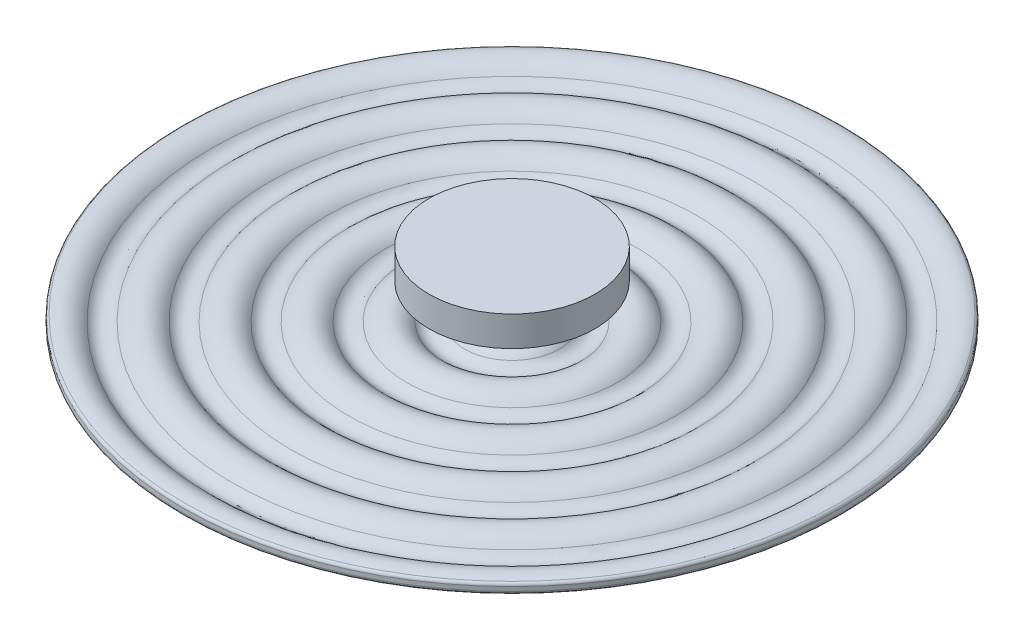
ISO-10303-21;
HEADER;
FILE_DESCRIPTION(('STEP AP214'),'2;1');
FILE_NAME('part.step','',(''),(''),'','','');
FILE_SCHEMA(('AUTOMOTIVE_DESIGN { 1 0 10303 214 1 1 1 1 }'));
ENDSEC;
DATA;
#1=APPLICATION_CONTEXT('core data for automotive mechanical design processes');
#2=APPLICATION_PROTOCOL_DEFINITION('international standard','automotive_design',2000,#1);
#3=PRODUCT_CONTEXT('',#1,'mechanical');
#4=PRODUCT('Part','Part','',(#3));
#5=PRODUCT_RELATED_PRODUCT_CATEGORY('part','',(#4));
#6=PRODUCT_DEFINITION_FORMATION('','',#4);
#7=PRODUCT_DEFINITION_CONTEXT('part definition',#1,'design');
#8=PRODUCT_DEFINITION('design','',#6,#7);
#9=PRODUCT_DEFINITION_SHAPE('','',#8);
#10=(LENGTH_UNIT() NAMED_UNIT(*) SI_UNIT(.MILLI.,.METRE.));
#11=(NAMED_UNIT(*) PLANE_ANGLE_UNIT() SI_UNIT($,.RADIAN.));
#12=(NAMED_UNIT(*) SI_UNIT($,.STERADIAN.) SOLID_ANGLE_UNIT());
#13=UNCERTAINTY_MEASURE_WITH_UNIT(LENGTH_MEASURE(1.E-05),#10,'distance_accuracy_value','');
#14=(GEOMETRIC_REPRESENTATION_CONTEXT(3) GLOBAL_UNCERTAINTY_ASSIGNED_CONTEXT((#13)) GLOBAL_UNIT_ASSIGNED_CONTEXT((#10,
#11,#12)) REPRESENTATION_CONTEXT('',''));
#15=CARTESIAN_POINT('',(0.,0.,0.));
#16=DIRECTION('',(0.,0.,1.));
#17=DIRECTION('',(1.,0.,0.));
#18=AXIS2_PLACEMENT_3D('',#15,#16,#17);
#19=CARTESIAN_POINT('',(0.,10.,0.));
#20=DIRECTION('',(0.,1.,0.));
#21=DIRECTION('',(1.,0.,0.));
#22=AXIS2_PLACEMENT_3D('',#19,#20,#21);
#23=SPHERICAL_SURFACE('',#22,11.);
#24=CARTESIAN_POINT('',(0.,2.66666666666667,0.));
#25=DIRECTION('',(0.,1.,0.));
#26=DIRECTION('',(-1.,0.,0.));
#27=AXIS2_PLACEMENT_3D('',#24,#25,#26);
#28=CIRCLE('',#27,8.19891591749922);
#29=CARTESIAN_POINT('',(8.19891591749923,2.66666666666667,0.));
#30=VERTEX_POINT('',#29);
#31=EDGE_CURVE('E155',#30,#30,#28,.T.);
#32=CARTESIAN_POINT('',(0.,0.202041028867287,0.));
#33=DIRECTION('',(0.,1.,0.));
#34=DIRECTION('',(0.,0.,1.));
#35=AXIS2_PLACEMENT_3D('',#32,#33,#34);
#36=CIRCLE('',#35,5.);
#37=CARTESIAN_POINT('',(4.99999999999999,0.202041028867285,0.));
#38=VERTEX_POINT('',#37);
#39=EDGE_CURVE('E70',#38,#38,#36,.T.);
#40=CARTESIAN_POINT('',(8.19891591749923,2.66666666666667,0.));
#41=CARTESIAN_POINT('',(8.17071262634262,2.63513441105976,0.));
#42=CARTESIAN_POINT('',(8.14232741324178,2.6037648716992,0.));
#43=CARTESIAN_POINT('',(8.08519695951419,2.54135536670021,0.));
#44=CARTESIAN_POINT('',(8.05645171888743,2.51031540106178,0.));
#45=CARTESIAN_POINT('',(7.9986050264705,2.44856918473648,0.));
#46=CARTESIAN_POINT('',(7.96950357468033,2.41786293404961,0.));
#47=CARTESIAN_POINT('',(7.91094833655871,2.35678823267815,0.));
#48=CARTESIAN_POINT('',(7.88149455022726,2.32641978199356,0.));
#49=CARTESIAN_POINT('',(7.82223856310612,2.26602472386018,0.));
#50=CARTESIAN_POINT('',(7.79243636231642,2.2359981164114,0.));
#51=CARTESIAN_POINT('',(7.73248751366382,2.17629074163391,0.));
#52=CARTESIAN_POINT('',(7.70234086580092,2.1466099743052,0.));
#53=CARTESIAN_POINT('',(7.6417071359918,2.08759823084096,0.));
#54=CARTESIAN_POINT('',(7.61122005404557,2.05826725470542,0.));
#55=CARTESIAN_POINT('',(7.54990951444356,1.99995899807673,0.));
#56=CARTESIAN_POINT('',(7.51908605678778,1.97098171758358,0.));
#57=CARTESIAN_POINT('',(7.45710686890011,1.91338470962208,0.));
#58=CARTESIAN_POINT('',(7.42595113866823,1.88476498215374,0.));
#59=CARTESIAN_POINT('',(7.36331155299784,1.82788689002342,0.));
#60=CARTESIAN_POINT('',(7.33182769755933,1.79962852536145,0.));
#61=CARTESIAN_POINT('',(7.26853605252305,1.74347692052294,0.));
#62=CARTESIAN_POINT('',(7.23672826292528,1.7155836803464,0.));
#63=CARTESIAN_POINT('',(7.17279298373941,1.66016603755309,0.));
#64=CARTESIAN_POINT('',(7.14066549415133,1.63264163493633,0.));
#65=CARTESIAN_POINT('',(7.07609509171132,1.57796533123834,0.));
#66=CARTESIAN_POINT('',(7.0436521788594,1.5508134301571,0.));
#67=CARTESIAN_POINT('',(6.97845524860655,1.49688574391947,0.));
#68=CARTESIAN_POINT('',(6.94570123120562,1.47010995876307,0.));
#69=CARTESIAN_POINT('',(6.87988645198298,1.41693806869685,0.));
#70=CARTESIAN_POINT('',(6.84682569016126,1.39054196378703,0.));
#71=CARTESIAN_POINT('',(6.78040182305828,1.3381329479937,0.));
#72=CARTESIAN_POINT('',(6.74703871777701,1.31212003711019,0.));
#73=CARTESIAN_POINT('',(6.68001460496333,1.26048087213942,0.));
#74=CARTESIAN_POINT('',(6.64635359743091,1.23485461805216,0.));
#75=CARTESIAN_POINT('',(6.57873816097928,1.18399217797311,0.));
#76=CARTESIAN_POINT('',(6.54478373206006,1.15875599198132,0.));
#77=CARTESIAN_POINT('',(6.47658597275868,1.10867704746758,0.));
#78=CARTESIAN_POINT('',(6.4423426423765,1.08383428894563,0.));
#79=CARTESIAN_POINT('',(6.37357163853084,1.03454550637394,0.));
#80=CARTESIAN_POINT('',(6.33904396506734,1.0100994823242,0.));
#81=CARTESIAN_POINT('',(6.26970887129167,0.961607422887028,0.));
#82=CARTESIAN_POINT('',(6.23490145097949,0.937561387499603,0.));
#83=CARTESIAN_POINT('',(6.16501149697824,0.889872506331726,0.));
#84=CARTESIAN_POINT('',(6.12992896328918,0.866229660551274,0.));
#85=CARTESIAN_POINT('',(6.05949345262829,0.819350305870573,0.));
#86=CARTESIAN_POINT('',(6.02414047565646,0.796113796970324,0.));
#87=CARTESIAN_POINT('',(5.95316878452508,0.750050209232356,0.));
#88=CARTESIAN_POINT('',(5.91755007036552,0.727223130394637,0.));
#89=CARTESIAN_POINT('',(5.84605164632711,0.681981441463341,0.));
#90=CARTESIAN_POINT('',(5.81017193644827,0.659566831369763,0.));
#91=CARTESIAN_POINT('',(5.73815629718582,0.615153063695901,0.));
#92=CARTESIAN_POINT('',(5.70202036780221,0.593153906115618,0.));
#93=CARTESIAN_POINT('',(5.62949709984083,0.549573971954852,0.));
#94=CARTESIAN_POINT('',(5.59310976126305,0.52799319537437,0.));
#95=CARTESIAN_POINT('',(5.52008851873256,0.485252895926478,0.));
#96=CARTESIAN_POINT('',(5.48345461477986,0.464093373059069,0.));
#97=CARTESIAN_POINT('',(5.40994511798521,0.422198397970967,0.));
#98=CARTESIAN_POINT('',(5.37306952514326,0.401462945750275,0.));
#99=CARTESIAN_POINT('',(5.2990815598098,0.360418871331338,0.));
#100=CARTESIAN_POINT('',(5.26196918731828,0.340110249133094,0.));
#101=CARTESIAN_POINT('',(5.18751260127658,0.299922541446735,0.));
#102=CARTESIAN_POINT('',(5.1501683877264,0.28004345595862,0.));
#103=CARTESIAN_POINT('',(5.07525309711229,0.240717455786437,0.));
#104=CARTESIAN_POINT('',(5.03768202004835,0.221270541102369,0.));
#105=CARTESIAN_POINT('',(4.99999999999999,0.202041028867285,0.));
#106=B_SPLINE_CURVE_WITH_KNOTS('',3,(#40,#41,#42,#43,#44,#45,#46,#47,#48,#49,#50,#51,#52,#53,
#54,#55,#56,#57,#58,#59,#60,#61,#62,#63,#64,#65,#66,#67,#68,#69,#70,#71,#72,#73,#74,#75,#76,#77,
#78,#79,#80,#81,#82,#83,#84,#85,#86,#87,#88,#89,#90,#91,#92,#93,#94,#95,#96,#97,#98,#99,#100,
#101,#102,#103,#104,#105),.UNSPECIFIED.,.F.,.F.,(4,2,2,2,2,2,2,2,2,2,2,2,2,2,2,2,2,2,2,2,2,2,2,
2,2,2,2,2,2,2,2,2,4),(0.,0.126914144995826,0.253828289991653,0.380742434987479,
0.507656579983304,0.63457072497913,0.761484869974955,0.888399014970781,1.01531315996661,
1.14222730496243,1.26914144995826,1.39605559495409,1.52296973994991,1.64988388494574,
1.77679802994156,1.90371217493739,2.03062631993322,2.15754046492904,2.28445460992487,
2.41136875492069,2.53828289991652,2.66519704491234,2.79211118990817,2.919025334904,
3.04593947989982,3.17285362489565,3.29976776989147,3.4266819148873,3.55359605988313,
3.68051020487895,3.80742434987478,3.9343384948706,4.06125263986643),.UNSPECIFIED.);
#107=EDGE_CURVE('BSEAM41',#30,#38,#106,.T.);
#108=ORIENTED_EDGE('',*,*,#31,.T.);
#109=ORIENTED_EDGE('',*,*,#39,.F.);
#110=ORIENTED_EDGE('',*,*,#107,.T.);
#111=ORIENTED_EDGE('',*,*,#107,.F.);
#112=EDGE_LOOP('',(#108,#110,#109,#111));
#113=FACE_BOUND('',#112,.T.);
#114=ADVANCED_FACE('F41',(#113),#23,.F.);
#115=CARTESIAN_POINT('',(0.,10.,0.));
#116=DIRECTION('',(0.,1.,0.));
#117=DIRECTION('',(-1.,0.,0.));
#118=AXIS2_PLACEMENT_3D('',#115,#116,#117);
#119=SPHERICAL_SURFACE('',#118,19.);
#120=CARTESIAN_POINT('',(0.,-2.66666666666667,0.));
#121=DIRECTION('',(0.,1.,0.));
#122=DIRECTION('',(-1.,0.,0.));
#123=AXIS2_PLACEMENT_3D('',#120,#121,#122);
#124=CIRCLE('',#123,14.1617638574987);
#125=CARTESIAN_POINT('',(-14.1617638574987,-2.66666666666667,0.));
#126=VERTEX_POINT('',#125);
#127=EDGE_CURVE('E65',#126,#126,#124,.T.);
#128=CARTESIAN_POINT('',(0.,-8.33030277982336,0.));
#129=DIRECTION('',(0.,1.,0.));
#130=DIRECTION('',(0.,0.,1.));
#131=AXIS2_PLACEMENT_3D('',#128,#129,#130);
#132=CIRCLE('',#131,5.);
#133=CARTESIAN_POINT('',(-4.99999999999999,-8.33030277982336,0.));
#134=VERTEX_POINT('',#133);
#135=EDGE_CURVE('E66',#134,#134,#132,.F.);
#136=CARTESIAN_POINT('',(-14.1617638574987,-2.66666666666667,0.));
#137=CARTESIAN_POINT('',(-14.0859256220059,-2.75145656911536,0.));
#138=CARTESIAN_POINT('',(-14.0093257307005,-2.83556522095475,0.));
#139=CARTESIAN_POINT('',(-13.8546277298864,-3.00239324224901,0.));
#140=CARTESIAN_POINT('',(-13.7765296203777,-3.08511261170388,0.));
#141=CARTESIAN_POINT('',(-13.6188602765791,-3.24913528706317,0.));
#142=CARTESIAN_POINT('',(-13.5392890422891,-3.3304385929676,0.));
#143=CARTESIAN_POINT('',(-13.3786991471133,-3.49160293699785,0.));
#144=CARTESIAN_POINT('',(-13.2976804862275,-3.57146397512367,0.));
#145=CARTESIAN_POINT('',(-13.1342218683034,-3.72971801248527,0.));
#146=CARTESIAN_POINT('',(-13.051781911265,-3.80811101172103,0.));
#147=CARTESIAN_POINT('',(-12.8855072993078,-3.96340368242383,0.));
#148=CARTESIAN_POINT('',(-12.801672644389,-4.04030335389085,0.));
#149=CARTESIAN_POINT('',(-12.6326356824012,-4.19258455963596,0.));
#150=CARTESIAN_POINT('',(-12.5474333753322,-4.26796609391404,0.));
#151=CARTESIAN_POINT('',(-12.3756885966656,-4.41718670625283,0.));
#152=CARTESIAN_POINT('',(-12.2891461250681,-4.49102578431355,0.));
#153=CARTESIAN_POINT('',(-12.1147489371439,-4.63713766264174,0.));
#154=CARTESIAN_POINT('',(-12.0268942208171,-4.70941046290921,0.));
#155=CARTESIAN_POINT('',(-11.8499008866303,-4.85236646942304,0.));
#156=CARTESIAN_POINT('',(-11.7607622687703,-4.9230496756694,0.));
#157=CARTESIAN_POINT('',(-11.581229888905,-5.06280369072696,0.));
#158=CARTESIAN_POINT('',(-11.4908361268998,-5.13187449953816,0.));
#159=CARTESIAN_POINT('',(-11.3088226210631,-5.26838143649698,0.));
#160=CARTESIAN_POINT('',(-11.2172028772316,-5.3358175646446,0.));
#161=CARTESIAN_POINT('',(-11.0327669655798,-5.46903338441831,0.));
#162=CARTESIAN_POINT('',(-10.9399507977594,-5.5348130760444,0.));
#163=CARTESIAN_POINT('',(-10.7531519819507,-5.66469480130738,0.));
#164=CARTESIAN_POINT('',(-10.6591693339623,-5.72879683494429,0.));
#165=CARTESIAN_POINT('',(-10.4700678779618,-5.8553025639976,0.));
#166=CARTESIAN_POINT('',(-10.3749490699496,-5.91770625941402,0.));
#167=CARTESIAN_POINT('',(-10.1836059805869,-6.04079517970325,0.));
#168=CARTESIAN_POINT('',(-10.0873816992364,-6.10148040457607,0.));
#169=CARTESIAN_POINT('',(-9.89385870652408,-6.22111280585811,0.));
#170=CARTESIAN_POINT('',(-9.79655999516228,-6.28005998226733,0.));
#171=CARTESIAN_POINT('',(-9.60091953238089,-6.39619726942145,0.));
#172=CARTESIAN_POINT('',(-9.5025777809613,-6.45338738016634,0.));
#173=CARTESIAN_POINT('',(-9.30488296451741,-6.56599208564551,0.));
#174=CARTESIAN_POINT('',(-9.20552989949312,-6.62140668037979,0.));
#175=CARTESIAN_POINT('',(-9.00584450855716,-6.73044247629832,0.));
#176=CARTESIAN_POINT('',(-8.90551218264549,-6.78406367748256,0.));
#177=CARTESIAN_POINT('',(-8.70390063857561,-6.88949538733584,0.));
#178=CARTESIAN_POINT('',(-8.60262142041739,-6.94130589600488,0.));
#179=CARTESIAN_POINT('',(-8.3991487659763,-7.04309950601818,0.));
#180=CARTESIAN_POINT('',(-8.29695532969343,-7.09308260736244,0.));
#181=CARTESIAN_POINT('',(-8.09168720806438,-7.19120527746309,0.));
#182=CARTESIAN_POINT('',(-7.9886125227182,-7.23934484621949,0.));
#183=CARTESIAN_POINT('',(-7.78161515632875,-7.33376492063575,0.));
#184=CARTESIAN_POINT('',(-7.67769247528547,-7.38004542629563,0.));
#185=CARTESIAN_POINT('',(-7.46903264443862,-7.47073244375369,0.));
#186=CARTESIAN_POINT('',(-7.36429549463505,-7.51513895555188,0.));
#187=CARTESIAN_POINT('',(-7.15404051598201,-7.60206365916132,0.));
#188=CARTESIAN_POINT('',(-7.04852268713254,-7.64458185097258,0.));
#189=CARTESIAN_POINT('',(-6.83674039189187,-7.72771619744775,0.));
#190=CARTESIAN_POINT('',(-6.73047592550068,-7.76833235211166,0.));
#191=CARTESIAN_POINT('',(-6.51723463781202,-7.84764952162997,0.));
#192=CARTESIAN_POINT('',(-6.41025781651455,-7.88635053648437,0.));
#193=CARTESIAN_POINT('',(-6.19562633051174,-7.96182493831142,0.));
#194=CARTESIAN_POINT('',(-6.08797166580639,-7.99859832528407,0.));
#195=CARTESIAN_POINT('',(-5.8720192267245,-8.07020561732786,0.));
#196=CARTESIAN_POINT('',(-5.76372145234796,-8.10503952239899,0.));
#197=CARTESIAN_POINT('',(-5.54651772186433,-8.17275657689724,0.));
#198=CARTESIAN_POINT('',(-5.43761176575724,-8.20563972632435,0.));
#199=CARTESIAN_POINT('',(-5.21922684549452,-8.2694447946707,0.));
#200=CARTESIAN_POINT('',(-5.10974788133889,-8.30036671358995,0.));
#201=CARTESIAN_POINT('',(-4.99999999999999,-8.33030277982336,0.));
#202=B_SPLINE_CURVE_WITH_KNOTS('',3,(#136,#137,#138,#139,#140,#141,#142,#143,#144,#145,#146,
#147,#148,#149,#150,#151,#152,#153,#154,#155,#156,#157,#158,#159,#160,#161,#162,#163,#164,#165,
#166,#167,#168,#169,#170,#171,#172,#173,#174,#175,#176,#177,#178,#179,#180,#181,#182,#183,#184,
#185,#186,#187,#188,#189,#190,#191,#192,#193,#194,#195,#196,#197,#198,#199,#200,#201),
.UNSPECIFIED.,.F.,.F.,(4,2,2,2,2,2,2,2,2,2,2,2,2,2,2,2,2,2,2,2,2,2,2,2,2,2,2,2,2,2,2,2,4),(0.,
0.341267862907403,0.682535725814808,1.02380358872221,1.36507145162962,1.70633931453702,
2.04760717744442,2.38887504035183,2.73014290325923,3.07141076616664,3.41267862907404,
3.75394649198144,4.09521435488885,4.43648221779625,4.77775008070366,5.11901794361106,
5.46028580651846,5.80155366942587,6.14282153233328,6.48408939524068,6.82535725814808,
7.16662512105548,7.50789298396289,7.84916084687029,8.1904287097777,8.5316965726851,
8.8729644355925,9.21423229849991,9.55550016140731,9.89676802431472,10.2380358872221,
10.5793037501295,10.9205716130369),.UNSPECIFIED.);
#203=EDGE_CURVE('BSEAM205',#126,#134,#202,.T.);
#204=ORIENTED_EDGE('',*,*,#127,.F.);
#205=ORIENTED_EDGE('',*,*,#135,.F.);
#206=ORIENTED_EDGE('',*,*,#203,.T.);
#207=ORIENTED_EDGE('',*,*,#203,.F.);
#208=EDGE_LOOP('',(#204,#206,#205,#207));
#209=FACE_BOUND('',#208,.T.);
#210=ADVANCED_FACE('F205',(#209),#119,.T.);
#211=CARTESIAN_POINT('',(0.,-9.99969599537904,0.));
#212=DIRECTION('',(0.,1.,0.));
#213=DIRECTION('',(-1.,0.,0.));
#214=AXIS2_PLACEMENT_3D('',#211,#212,#213);
#215=TOROIDAL_SURFACE('',#214,22.3603398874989,10.9995439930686);
#216=CARTESIAN_POINT('',(0.,-2.66666666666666,0.));
#217=DIRECTION('',(0.,1.,0.));
#218=DIRECTION('',(-1.,0.,0.));
#219=AXIS2_PLACEMENT_3D('',#216,#217,#218);
#220=CIRCLE('',#219,30.5589159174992);
#221=CARTESIAN_POINT('',(-30.5589159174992,-2.66666666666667,0.));
#222=VERTEX_POINT('',#221);
#223=EDGE_CURVE('E75',#222,#222,#220,.T.);
#224=ORIENTED_EDGE('',*,*,#223,.F.);
#225=EDGE_LOOP('',(#224));
#226=FACE_BOUND('',#225,.T.);
#227=ORIENTED_EDGE('',*,*,#127,.T.);
#228=EDGE_LOOP('',(#227));
#229=FACE_BOUND('',#228,.T.);
#230=ADVANCED_FACE('F211',(#226,#229),#215,.F.);
#231=CARTESIAN_POINT('',(0.,9.99969599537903,0.));
#232=DIRECTION('',(0.,1.,0.));
#233=DIRECTION('',(-1.,0.,0.));
#234=AXIS2_PLACEMENT_3D('',#231,#232,#233);
#235=TOROIDAL_SURFACE('',#234,44.7203398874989,18.9995439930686);
#236=CARTESIAN_POINT('',(0.,-2.66666666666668,0.));
#237=DIRECTION('',(0.,1.,0.));
#238=DIRECTION('',(-1.,0.,0.));
#239=AXIS2_PLACEMENT_3D('',#236,#237,#238);
#240=CIRCLE('',#239,58.8817638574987);
#241=CARTESIAN_POINT('',(-58.8817638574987,-2.66666666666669,0.));
#242=VERTEX_POINT('',#241);
#243=EDGE_CURVE('E79',#242,#242,#240,.T.);
#244=ORIENTED_EDGE('',*,*,#243,.F.);
#245=EDGE_LOOP('',(#244));
#246=FACE_BOUND('',#245,.T.);
#247=ORIENTED_EDGE('',*,*,#223,.T.);
#248=EDGE_LOOP('',(#247));
#249=FACE_BOUND('',#248,.T.);
#250=ADVANCED_FACE('F289',(#246,#249),#235,.T.);
#251=CARTESIAN_POINT('',(0.,-9.99969599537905,0.));
#252=DIRECTION('',(0.,1.,0.));
#253=DIRECTION('',(-1.,0.,0.));
#254=AXIS2_PLACEMENT_3D('',#251,#252,#253);
#255=TOROIDAL_SURFACE('',#254,67.080339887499,10.9995439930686);
#256=CARTESIAN_POINT('',(0.,-2.66666666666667,0.));
#257=DIRECTION('',(0.,1.,0.));
#258=DIRECTION('',(-1.,0.,0.));
#259=AXIS2_PLACEMENT_3D('',#256,#257,#258);
#260=CIRCLE('',#259,75.2789159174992);
#261=CARTESIAN_POINT('',(-75.2789159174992,-2.66666666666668,0.));
#262=VERTEX_POINT('',#261);
#263=EDGE_CURVE('E83',#262,#262,#260,.T.);
#264=ORIENTED_EDGE('',*,*,#263,.F.);
#265=EDGE_LOOP('',(#264));
#266=FACE_BOUND('',#265,.T.);
#267=ORIENTED_EDGE('',*,*,#243,.T.);
#268=EDGE_LOOP('',(#267));
#269=FACE_BOUND('',#268,.T.);
#270=ADVANCED_FACE('F285',(#266,#269),#255,.F.);
#271=CARTESIAN_POINT('',(0.,9.99969599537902,0.));
#272=DIRECTION('',(0.,1.,0.));
#273=DIRECTION('',(-1.,0.,0.));
#274=AXIS2_PLACEMENT_3D('',#271,#272,#273);
#275=TOROIDAL_SURFACE('',#274,89.4403398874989,18.9995439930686);
#276=CARTESIAN_POINT('',(0.,-2.66666666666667,0.));
#277=DIRECTION('',(0.,1.,0.));
#278=DIRECTION('',(-1.,0.,0.));
#279=AXIS2_PLACEMENT_3D('',#276,#277,#278);
#280=CIRCLE('',#279,103.601763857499);
#281=CARTESIAN_POINT('',(-103.601763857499,-2.66666666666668,0.));
#282=VERTEX_POINT('',#281);
#283=EDGE_CURVE('E87',#282,#282,#280,.T.);
#284=ORIENTED_EDGE('',*,*,#283,.F.);
#285=EDGE_LOOP('',(#284));
#286=FACE_BOUND('',#285,.T.);
#287=ORIENTED_EDGE('',*,*,#263,.T.);
#288=EDGE_LOOP('',(#287));
#289=FACE_BOUND('',#288,.T.);
#290=ADVANCED_FACE('F281',(#286,#289),#275,.T.);
#291=CARTESIAN_POINT('',(0.,-9.99969599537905,0.));
#292=DIRECTION('',(0.,1.,0.));
#293=DIRECTION('',(-1.,0.,0.));
#294=AXIS2_PLACEMENT_3D('',#291,#292,#293);
#295=TOROIDAL_SURFACE('',#294,111.800339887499,10.9995439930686);
#296=CARTESIAN_POINT('',(0.,-2.66666666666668,0.));
#297=DIRECTION('',(0.,1.,0.));
#298=DIRECTION('',(-1.,0.,0.));
#299=AXIS2_PLACEMENT_3D('',#296,#297,#298);
#300=CIRCLE('',#299,119.998915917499);
#301=CARTESIAN_POINT('',(-119.998915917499,-2.66666666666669,0.));
#302=VERTEX_POINT('',#301);
#303=EDGE_CURVE('E91',#302,#302,#300,.T.);
#304=ORIENTED_EDGE('',*,*,#303,.F.);
#305=EDGE_LOOP('',(#304));
#306=FACE_BOUND('',#305,.T.);
#307=ORIENTED_EDGE('',*,*,#283,.T.);
#308=EDGE_LOOP('',(#307));
#309=FACE_BOUND('',#308,.T.);
#310=ADVANCED_FACE('F277',(#306,#309),#295,.F.);
#311=CARTESIAN_POINT('',(0.,9.99969599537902,0.));
#312=DIRECTION('',(0.,1.,0.));
#313=DIRECTION('',(-1.,0.,0.));
#314=AXIS2_PLACEMENT_3D('',#311,#312,#313);
#315=TOROIDAL_SURFACE('',#314,134.160339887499,18.9995439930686);
#316=CARTESIAN_POINT('',(0.,-2.66666666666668,0.));
#317=DIRECTION('',(0.,1.,0.));
#318=DIRECTION('',(-1.,0.,0.));
#319=AXIS2_PLACEMENT_3D('',#316,#317,#318);
#320=CIRCLE('',#319,148.321763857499);
#321=CARTESIAN_POINT('',(-148.321763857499,-2.6666666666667,0.));
#322=VERTEX_POINT('',#321);
#323=EDGE_CURVE('E95',#322,#322,#320,.T.);
#324=ORIENTED_EDGE('',*,*,#323,.F.);
#325=EDGE_LOOP('',(#324));
#326=FACE_BOUND('',#325,.T.);
#327=ORIENTED_EDGE('',*,*,#303,.T.);
#328=EDGE_LOOP('',(#327));
#329=FACE_BOUND('',#328,.T.);
#330=ADVANCED_FACE('F273',(#326,#329),#315,.T.);
#331=CARTESIAN_POINT('',(0.,-9.99969599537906,0.));
#332=DIRECTION('',(0.,1.,0.));
#333=DIRECTION('',(-1.,0.,0.));
#334=AXIS2_PLACEMENT_3D('',#331,#332,#333);
#335=TOROIDAL_SURFACE('',#334,156.520339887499,10.9995439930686);
#336=CARTESIAN_POINT('',(0.,-2.66666666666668,0.));
#337=DIRECTION('',(0.,1.,0.));
#338=DIRECTION('',(-1.,0.,0.));
#339=AXIS2_PLACEMENT_3D('',#336,#337,#338);
#340=CIRCLE('',#339,164.718915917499);
#341=CARTESIAN_POINT('',(-164.718915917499,-2.6666666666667,0.));
#342=VERTEX_POINT('',#341);
#343=EDGE_CURVE('E99',#342,#342,#340,.T.);
#344=ORIENTED_EDGE('',*,*,#343,.F.);
#345=EDGE_LOOP('',(#344));
#346=FACE_BOUND('',#345,.T.);
#347=ORIENTED_EDGE('',*,*,#323,.T.);
#348=EDGE_LOOP('',(#347));
#349=FACE_BOUND('',#348,.T.);
#350=ADVANCED_FACE('F269',(#346,#349),#335,.F.);
#351=CARTESIAN_POINT('',(0.,9.99969599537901,0.));
#352=DIRECTION('',(0.,1.,0.));
#353=DIRECTION('',(-1.,0.,0.));
#354=AXIS2_PLACEMENT_3D('',#351,#352,#353);
#355=TOROIDAL_SURFACE('',#354,178.880339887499,18.9995439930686);
#356=CARTESIAN_POINT('',(0.,-2.6666666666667,0.));
#357=DIRECTION('',(0.,1.,0.));
#358=DIRECTION('',(-1.,0.,0.));
#359=AXIS2_PLACEMENT_3D('',#356,#357,#358);
#360=CIRCLE('',#359,193.041763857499);
#361=CARTESIAN_POINT('',(-193.041763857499,-2.66666666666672,0.));
#362=VERTEX_POINT('',#361);
#363=EDGE_CURVE('E103',#362,#362,#360,.T.);
#364=ORIENTED_EDGE('',*,*,#363,.F.);
#365=EDGE_LOOP('',(#364));
#366=FACE_BOUND('',#365,.T.);
#367=ORIENTED_EDGE('',*,*,#343,.T.);
#368=EDGE_LOOP('',(#367));
#369=FACE_BOUND('',#368,.T.);
#370=ADVANCED_FACE('F265',(#366,#369),#355,.T.);
#371=CARTESIAN_POINT('',(0.,-9.99969599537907,0.));
#372=DIRECTION('',(0.,1.,0.));
#373=DIRECTION('',(-1.,0.,0.));
#374=AXIS2_PLACEMENT_3D('',#371,#372,#373);
#375=TOROIDAL_SURFACE('',#374,201.240339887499,10.9995439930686);
#376=CARTESIAN_POINT('',(0.,-2.66666666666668,0.));
#377=DIRECTION('',(0.,1.,0.));
#378=DIRECTION('',(-1.,0.,0.));
#379=AXIS2_PLACEMENT_3D('',#376,#377,#378);
#380=CIRCLE('',#379,209.438915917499);
#381=CARTESIAN_POINT('',(-209.438915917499,-2.66666666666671,0.));
#382=VERTEX_POINT('',#381);
#383=EDGE_CURVE('E107',#382,#382,#380,.T.);
#384=ORIENTED_EDGE('',*,*,#383,.F.);
#385=EDGE_LOOP('',(#384));
#386=FACE_BOUND('',#385,.T.);
#387=ORIENTED_EDGE('',*,*,#363,.T.);
#388=EDGE_LOOP('',(#387));
#389=FACE_BOUND('',#388,.T.);
#390=ADVANCED_FACE('F261',(#386,#389),#375,.F.);
#391=CARTESIAN_POINT('',(0.,9.999695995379,0.));
#392=DIRECTION('',(0.,1.,0.));
#393=DIRECTION('',(-1.,0.,0.));
#394=AXIS2_PLACEMENT_3D('',#391,#392,#393);
#395=TOROIDAL_SURFACE('',#394,223.600339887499,18.9995439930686);
#396=CARTESIAN_POINT('',(0.,-2.6666666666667,0.));
#397=DIRECTION('',(0.,1.,0.));
#398=DIRECTION('',(-1.,0.,0.));
#399=AXIS2_PLACEMENT_3D('',#396,#397,#398);
#400=CIRCLE('',#399,237.761763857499);
#401=CARTESIAN_POINT('',(-237.761763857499,-2.66666666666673,0.));
#402=VERTEX_POINT('',#401);
#403=EDGE_CURVE('E111',#402,#402,#400,.T.);
#404=ORIENTED_EDGE('',*,*,#403,.F.);
#405=EDGE_LOOP('',(#404));
#406=FACE_BOUND('',#405,.T.);
#407=ORIENTED_EDGE('',*,*,#383,.T.);
#408=EDGE_LOOP('',(#407));
#409=FACE_BOUND('',#408,.T.);
#410=ADVANCED_FACE('F258',(#406,#409),#395,.T.);
#411=CARTESIAN_POINT('',(0.,-9.99969599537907,0.));
#412=DIRECTION('',(0.,1.,0.));
#413=DIRECTION('',(-1.,0.,0.));
#414=AXIS2_PLACEMENT_3D('',#411,#412,#413);
#415=TOROIDAL_SURFACE('',#414,245.960339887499,10.9995439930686);
#416=CARTESIAN_POINT('',(0.,-0.0282261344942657,0.));
#417=DIRECTION('',(0.,-1.,0.));
#418=DIRECTION('',(1.,0.,0.));
#419=AXIS2_PLACEMENT_3D('',#416,#417,#418);
#420=CIRCLE('',#419,250.603588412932);
#421=CARTESIAN_POINT('',(250.603588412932,-0.028226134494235,0.));
#422=VERTEX_POINT('',#421);
#423=EDGE_CURVE('E10',#422,#422,#420,.T.);
#424=ORIENTED_EDGE('',*,*,#423,.T.);
#425=EDGE_LOOP('',(#424));
#426=FACE_BOUND('',#425,.T.);
#427=ORIENTED_EDGE('',*,*,#403,.T.);
#428=EDGE_LOOP('',(#427));
#429=FACE_BOUND('',#428,.T.);
#430=ADVANCED_FACE('F255',(#426,#429),#415,.F.);
#431=CARTESIAN_POINT('',(0.,10.,0.));
#432=DIRECTION('',(0.,1.,0.));
#433=DIRECTION('',(-1.,0.,0.));
#434=AXIS2_PLACEMENT_3D('',#431,#432,#433);
#435=CYLINDRICAL_SURFACE('',#434,254.158915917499);
#436=CARTESIAN_POINT('',(0.,5.48452769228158,0.));
#437=DIRECTION('',(0.,-1.,0.));
#438=DIRECTION('',(1.,0.,0.));
#439=AXIS2_PLACEMENT_3D('',#436,#437,#438);
#440=CIRCLE('',#439,254.158915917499);
#441=CARTESIAN_POINT('',(254.158915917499,5.48452769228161,0.));
#442=VERTEX_POINT('',#441);
#443=EDGE_CURVE('E49',#442,#442,#440,.T.);
#444=ORIENTED_EDGE('',*,*,#443,.T.);
#445=EDGE_LOOP('',(#444));
#446=FACE_BOUND('',#445,.T.);
#447=CARTESIAN_POINT('',(0.,2.23811096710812,0.));
#448=DIRECTION('',(0.,-1.,0.));
#449=DIRECTION('',(1.,0.,0.));
#450=AXIS2_PLACEMENT_3D('',#447,#448,#449);
#451=CIRCLE('',#450,254.158915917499);
#452=CARTESIAN_POINT('',(254.158915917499,2.23811096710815,0.));
#453=VERTEX_POINT('',#452);
#454=EDGE_CURVE('E54',#453,#453,#451,.F.);
#455=ORIENTED_EDGE('',*,*,#454,.T.);
#456=EDGE_LOOP('',(#455));
#457=FACE_BOUND('',#456,.T.);
#458=ADVANCED_FACE('F236',(#446,#457),#435,.T.);
#459=CARTESIAN_POINT('',(0.,-9.99969599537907,0.));
#460=DIRECTION('',(0.,1.,0.));
#461=DIRECTION('',(-1.,0.,0.));
#462=AXIS2_PLACEMENT_3D('',#459,#460,#461);
#463=TOROIDAL_SURFACE('',#462,245.960339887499,18.9995439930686);
#464=CARTESIAN_POINT('',(0.,7.83068703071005,0.));
#465=DIRECTION('',(0.,-1.,0.));
#466=DIRECTION('',(1.,0.,0.));
#467=AXIS2_PLACEMENT_3D('',#464,#465,#466);
#468=CIRCLE('',#467,252.522360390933);
#469=CARTESIAN_POINT('',(252.522360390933,7.83068703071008,0.));
#470=VERTEX_POINT('',#469);
#471=EDGE_CURVE('E59',#470,#470,#468,.F.);
#472=ORIENTED_EDGE('',*,*,#471,.T.);
#473=EDGE_LOOP('',(#472));
#474=FACE_BOUND('',#473,.T.);
#475=CARTESIAN_POINT('',(0.,2.66666666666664,0.));
#476=DIRECTION('',(0.,1.,0.));
#477=DIRECTION('',(-1.,0.,0.));
#478=AXIS2_PLACEMENT_3D('',#475,#476,#477);
#479=CIRCLE('',#478,231.798915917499);
#480=CARTESIAN_POINT('',(-231.798915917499,2.66666666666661,0.));
#481=VERTEX_POINT('',#480);
#482=EDGE_CURVE('E115',#481,#481,#479,.T.);
#483=ORIENTED_EDGE('',*,*,#482,.F.);
#484=EDGE_LOOP('',(#483));
#485=FACE_BOUND('',#484,.T.);
#486=ADVANCED_FACE('F232',(#474,#485),#463,.T.);
#487=CARTESIAN_POINT('',(0.,9.999695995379,0.));
#488=DIRECTION('',(0.,1.,0.));
#489=DIRECTION('',(-1.,0.,0.));
#490=AXIS2_PLACEMENT_3D('',#487,#488,#489);
#491=TOROIDAL_SURFACE('',#490,223.600339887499,10.9995439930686);
#492=CARTESIAN_POINT('',(0.,2.66666666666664,0.));
#493=DIRECTION('',(0.,1.,0.));
#494=DIRECTION('',(-1.,0.,0.));
#495=AXIS2_PLACEMENT_3D('',#492,#493,#494);
#496=CIRCLE('',#495,215.401763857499);
#497=CARTESIAN_POINT('',(-215.401763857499,2.66666666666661,0.));
#498=VERTEX_POINT('',#497);
#499=EDGE_CURVE('E119',#498,#498,#496,.T.);
#500=ORIENTED_EDGE('',*,*,#499,.F.);
#501=EDGE_LOOP('',(#500));
#502=FACE_BOUND('',#501,.T.);
#503=ORIENTED_EDGE('',*,*,#482,.T.);
#504=EDGE_LOOP('',(#503));
#505=FACE_BOUND('',#504,.T.);
#506=ADVANCED_FACE('F235',(#502,#505),#491,.F.);
#507=CARTESIAN_POINT('',(0.,-9.99969599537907,0.));
#508=DIRECTION('',(0.,1.,0.));
#509=DIRECTION('',(-1.,0.,0.));
#510=AXIS2_PLACEMENT_3D('',#507,#508,#509);
#511=TOROIDAL_SURFACE('',#510,201.240339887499,18.9995439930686);
#512=CARTESIAN_POINT('',(0.,2.66666666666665,0.));
#513=DIRECTION('',(0.,1.,0.));
#514=DIRECTION('',(-1.,0.,0.));
#515=AXIS2_PLACEMENT_3D('',#512,#513,#514);
#516=CIRCLE('',#515,187.078915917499);
#517=CARTESIAN_POINT('',(-187.078915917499,2.66666666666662,0.));
#518=VERTEX_POINT('',#517);
#519=EDGE_CURVE('E123',#518,#518,#516,.T.);
#520=ORIENTED_EDGE('',*,*,#519,.F.);
#521=EDGE_LOOP('',(#520));
#522=FACE_BOUND('',#521,.T.);
#523=ORIENTED_EDGE('',*,*,#499,.T.);
#524=EDGE_LOOP('',(#523));
#525=FACE_BOUND('',#524,.T.);
#526=ADVANCED_FACE('F241',(#522,#525),#511,.T.);
#527=CARTESIAN_POINT('',(0.,9.99969599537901,0.));
#528=DIRECTION('',(0.,1.,0.));
#529=DIRECTION('',(-1.,0.,0.));
#530=AXIS2_PLACEMENT_3D('',#527,#528,#529);
#531=TOROIDAL_SURFACE('',#530,178.880339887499,10.9995439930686);
#532=CARTESIAN_POINT('',(0.,2.66666666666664,0.));
#533=DIRECTION('',(0.,1.,0.));
#534=DIRECTION('',(-1.,0.,0.));
#535=AXIS2_PLACEMENT_3D('',#532,#533,#534);
#536=CIRCLE('',#535,170.681763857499);
#537=CARTESIAN_POINT('',(-170.681763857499,2.66666666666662,0.));
#538=VERTEX_POINT('',#537);
#539=EDGE_CURVE('E127',#538,#538,#536,.T.);
#540=ORIENTED_EDGE('',*,*,#539,.F.);
#541=EDGE_LOOP('',(#540));
#542=FACE_BOUND('',#541,.T.);
#543=ORIENTED_EDGE('',*,*,#519,.T.);
#544=EDGE_LOOP('',(#543));
#545=FACE_BOUND('',#544,.T.);
#546=ADVANCED_FACE('F247',(#542,#545),#531,.F.);
#547=CARTESIAN_POINT('',(0.,-9.99969599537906,0.));
#548=DIRECTION('',(0.,1.,0.));
#549=DIRECTION('',(-1.,0.,0.));
#550=AXIS2_PLACEMENT_3D('',#547,#548,#549);
#551=TOROIDAL_SURFACE('',#550,156.520339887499,18.9995439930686);
#552=CARTESIAN_POINT('',(0.,2.66666666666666,0.));
#553=DIRECTION('',(0.,1.,0.));
#554=DIRECTION('',(-1.,0.,0.));
#555=AXIS2_PLACEMENT_3D('',#552,#553,#554);
#556=CIRCLE('',#555,142.358915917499);
#557=CARTESIAN_POINT('',(-142.358915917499,2.66666666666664,0.));
#558=VERTEX_POINT('',#557);
#559=EDGE_CURVE('E131',#558,#558,#556,.T.);
#560=ORIENTED_EDGE('',*,*,#559,.F.);
#561=EDGE_LOOP('',(#560));
#562=FACE_BOUND('',#561,.T.);
#563=ORIENTED_EDGE('',*,*,#539,.T.);
#564=EDGE_LOOP('',(#563));
#565=FACE_BOUND('',#564,.T.);
#566=ADVANCED_FACE('F333',(#562,#565),#551,.T.);
#567=CARTESIAN_POINT('',(0.,9.99969599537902,0.));
#568=DIRECTION('',(0.,1.,0.));
#569=DIRECTION('',(-1.,0.,0.));
#570=AXIS2_PLACEMENT_3D('',#567,#568,#569);
#571=TOROIDAL_SURFACE('',#570,134.160339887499,10.9995439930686);
#572=CARTESIAN_POINT('',(0.,2.66666666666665,0.));
#573=DIRECTION('',(0.,1.,0.));
#574=DIRECTION('',(-1.,0.,0.));
#575=AXIS2_PLACEMENT_3D('',#572,#573,#574);
#576=CIRCLE('',#575,125.961763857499);
#577=CARTESIAN_POINT('',(-125.961763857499,2.66666666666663,0.));
#578=VERTEX_POINT('',#577);
#579=EDGE_CURVE('E135',#578,#578,#576,.T.);
#580=ORIENTED_EDGE('',*,*,#579,.F.);
#581=EDGE_LOOP('',(#580));
#582=FACE_BOUND('',#581,.T.);
#583=ORIENTED_EDGE('',*,*,#559,.T.);
#584=EDGE_LOOP('',(#583));
#585=FACE_BOUND('',#584,.T.);
#586=ADVANCED_FACE('F329',(#582,#585),#571,.F.);
#587=CARTESIAN_POINT('',(0.,-9.99969599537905,0.));
#588=DIRECTION('',(0.,1.,0.));
#589=DIRECTION('',(-1.,0.,0.));
#590=AXIS2_PLACEMENT_3D('',#587,#588,#589);
#591=TOROIDAL_SURFACE('',#590,111.800339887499,18.9995439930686);
#592=CARTESIAN_POINT('',(0.,2.66666666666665,0.));
#593=DIRECTION('',(0.,1.,0.));
#594=DIRECTION('',(-1.,0.,0.));
#595=AXIS2_PLACEMENT_3D('',#592,#593,#594);
#596=CIRCLE('',#595,97.6389159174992);
#597=CARTESIAN_POINT('',(-97.6389159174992,2.66666666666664,0.));
#598=VERTEX_POINT('',#597);
#599=EDGE_CURVE('E139',#598,#598,#596,.T.);
#600=ORIENTED_EDGE('',*,*,#599,.F.);
#601=EDGE_LOOP('',(#600));
#602=FACE_BOUND('',#601,.T.);
#603=ORIENTED_EDGE('',*,*,#579,.T.);
#604=EDGE_LOOP('',(#603));
#605=FACE_BOUND('',#604,.T.);
#606=ADVANCED_FACE('F325',(#602,#605),#591,.T.);
#607=CARTESIAN_POINT('',(0.,9.99969599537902,0.));
#608=DIRECTION('',(0.,1.,0.));
#609=DIRECTION('',(-1.,0.,0.));
#610=AXIS2_PLACEMENT_3D('',#607,#608,#609);
#611=TOROIDAL_SURFACE('',#610,89.4403398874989,10.9995439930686);
#612=CARTESIAN_POINT('',(0.,2.66666666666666,0.));
#613=DIRECTION('',(0.,1.,0.));
#614=DIRECTION('',(-1.,0.,0.));
#615=AXIS2_PLACEMENT_3D('',#612,#613,#614);
#616=CIRCLE('',#615,81.2417638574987);
#617=CARTESIAN_POINT('',(-81.2417638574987,2.66666666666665,0.));
#618=VERTEX_POINT('',#617);
#619=EDGE_CURVE('E143',#618,#618,#616,.T.);
#620=ORIENTED_EDGE('',*,*,#619,.F.);
#621=EDGE_LOOP('',(#620));
#622=FACE_BOUND('',#621,.T.);
#623=ORIENTED_EDGE('',*,*,#599,.T.);
#624=EDGE_LOOP('',(#623));
#625=FACE_BOUND('',#624,.T.);
#626=ADVANCED_FACE('F321',(#622,#625),#611,.F.);
#627=CARTESIAN_POINT('',(0.,-9.99969599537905,0.));
#628=DIRECTION('',(0.,1.,0.));
#629=DIRECTION('',(-1.,0.,0.));
#630=AXIS2_PLACEMENT_3D('',#627,#628,#629);
#631=TOROIDAL_SURFACE('',#630,67.080339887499,18.9995439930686);
#632=CARTESIAN_POINT('',(0.,2.66666666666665,0.));
#633=DIRECTION('',(0.,1.,0.));
#634=DIRECTION('',(-1.,0.,0.));
#635=AXIS2_PLACEMENT_3D('',#632,#633,#634);
#636=CIRCLE('',#635,52.9189159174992);
#637=CARTESIAN_POINT('',(-52.9189159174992,2.66666666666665,0.));
#638=VERTEX_POINT('',#637);
#639=EDGE_CURVE('E147',#638,#638,#636,.T.);
#640=ORIENTED_EDGE('',*,*,#639,.F.);
#641=EDGE_LOOP('',(#640));
#642=FACE_BOUND('',#641,.T.);
#643=ORIENTED_EDGE('',*,*,#619,.T.);
#644=EDGE_LOOP('',(#643));
#645=FACE_BOUND('',#644,.T.);
#646=ADVANCED_FACE('F317',(#642,#645),#631,.T.);
#647=CARTESIAN_POINT('',(0.,9.99969599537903,0.));
#648=DIRECTION('',(0.,1.,0.));
#649=DIRECTION('',(-1.,0.,0.));
#650=AXIS2_PLACEMENT_3D('',#647,#648,#649);
#651=TOROIDAL_SURFACE('',#650,44.7203398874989,10.9995439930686);
#652=CARTESIAN_POINT('',(0.,2.66666666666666,0.));
#653=DIRECTION('',(0.,1.,0.));
#654=DIRECTION('',(-1.,0.,0.));
#655=AXIS2_PLACEMENT_3D('',#652,#653,#654);
#656=CIRCLE('',#655,36.5217638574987);
#657=CARTESIAN_POINT('',(-36.5217638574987,2.66666666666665,0.));
#658=VERTEX_POINT('',#657);
#659=EDGE_CURVE('E151',#658,#658,#656,.T.);
#660=ORIENTED_EDGE('',*,*,#659,.F.);
#661=EDGE_LOOP('',(#660));
#662=FACE_BOUND('',#661,.T.);
#663=ORIENTED_EDGE('',*,*,#639,.T.);
#664=EDGE_LOOP('',(#663));
#665=FACE_BOUND('',#664,.T.);
#666=ADVANCED_FACE('F226',(#662,#665),#651,.F.);
#667=CARTESIAN_POINT('',(0.,-9.99969599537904,0.));
#668=DIRECTION('',(0.,1.,0.));
#669=DIRECTION('',(-1.,0.,0.));
#670=AXIS2_PLACEMENT_3D('',#667,#668,#669);
#671=TOROIDAL_SURFACE('',#670,22.3603398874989,18.9995439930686);
#672=ORIENTED_EDGE('',*,*,#31,.F.);
#673=EDGE_LOOP('',(#672));
#674=FACE_BOUND('',#673,.T.);
#675=ORIENTED_EDGE('',*,*,#659,.T.);
#676=EDGE_LOOP('',(#675));
#677=FACE_BOUND('',#676,.T.);
#678=ADVANCED_FACE('F218',(#674,#677),#671,.T.);
#679=CARTESIAN_POINT('',(0.,5.48452769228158,0.));
#680=DIRECTION('',(0.,-1.,0.));
#681=DIRECTION('',(1.,0.,0.));
#682=AXIS2_PLACEMENT_3D('',#679,#680,#681);
#683=TOROIDAL_SURFACE('',#682,251.658915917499,2.5);
#684=ORIENTED_EDGE('',*,*,#443,.F.);
#685=EDGE_LOOP('',(#684));
#686=FACE_BOUND('',#685,.T.);
#687=ORIENTED_EDGE('',*,*,#471,.F.);
#688=EDGE_LOOP('',(#687));
#689=FACE_BOUND('',#688,.T.);
#690=ADVANCED_FACE('F216',(#686,#689),#683,.T.);
#691=CARTESIAN_POINT('',(0.,2.23811096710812,0.));
#692=DIRECTION('',(0.,-1.,0.));
#693=DIRECTION('',(1.,0.,0.));
#694=AXIS2_PLACEMENT_3D('',#691,#692,#693);
#695=TOROIDAL_SURFACE('',#694,251.658915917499,2.5);
#696=ORIENTED_EDGE('',*,*,#423,.F.);
#697=EDGE_LOOP('',(#696));
#698=FACE_BOUND('',#697,.T.);
#699=ORIENTED_EDGE('',*,*,#454,.F.);
#700=EDGE_LOOP('',(#699));
#701=FACE_BOUND('',#700,.T.);
#702=ADVANCED_FACE('F43',(#698,#701),#695,.T.);
#703=CARTESIAN_POINT('',(0.,-9.5,0.));
#704=DIRECTION('',(0.,1.,0.));
#705=DIRECTION('',(0.,0.,1.));
#706=AXIS2_PLACEMENT_3D('',#703,#704,#705);
#707=CYLINDRICAL_SURFACE('',#706,5.);
#708=CARTESIAN_POINT('',(0.,-9.5,0.));
#709=DIRECTION('',(0.,1.,0.));
#710=DIRECTION('',(0.,0.,1.));
#711=AXIS2_PLACEMENT_3D('',#708,#709,#710);
#712=CIRCLE('',#711,5.);
#713=CARTESIAN_POINT('',(0.,-9.5,5.));
#714=VERTEX_POINT('',#713);
#715=EDGE_CURVE('E162',#714,#714,#712,.T.);
#716=ORIENTED_EDGE('',*,*,#715,.T.);
#717=EDGE_LOOP('',(#716));
#718=FACE_BOUND('',#717,.T.);
#719=ORIENTED_EDGE('',*,*,#135,.T.);
#720=EDGE_LOOP('',(#719));
#721=FACE_BOUND('',#720,.T.);
#722=ADVANCED_FACE('F224',(#718,#721),#707,.T.);
#723=CARTESIAN_POINT('',(0.,29.972,0.));
#724=DIRECTION('',(0.,1.,0.));
#725=DIRECTION('',(0.,0.,1.));
#726=AXIS2_PLACEMENT_3D('',#723,#724,#725);
#727=CIRCLE('',#726,5.);
#728=CARTESIAN_POINT('',(0.,29.972,5.));
#729=VERTEX_POINT('',#728);
#730=EDGE_CURVE('E71',#729,#729,#727,.T.);
#731=ORIENTED_EDGE('',*,*,#730,.F.);
#732=EDGE_LOOP('',(#731));
#733=FACE_BOUND('',#732,.T.);
#734=ORIENTED_EDGE('',*,*,#39,.T.);
#735=EDGE_LOOP('',(#734));
#736=FACE_BOUND('',#735,.T.);
#737=ADVANCED_FACE('F304',(#733,#736),#707,.T.);
#738=CARTESIAN_POINT('',(0.,53.086,0.));
#739=DIRECTION('',(0.,-1.,0.));
#740=DIRECTION('',(0.,0.,-1.));
#741=AXIS2_PLACEMENT_3D('',#738,#739,#740);
#742=CYLINDRICAL_SURFACE('',#741,64.008);
#743=CARTESIAN_POINT('',(0.,53.086,0.));
#744=DIRECTION('',(0.,1.,0.));
#745=DIRECTION('',(0.,0.,1.));
#746=AXIS2_PLACEMENT_3D('',#743,#744,#745);
#747=CIRCLE('',#746,64.008);
#748=CARTESIAN_POINT('',(0.,53.086,64.008));
#749=VERTEX_POINT('',#748);
#750=EDGE_CURVE('E171',#749,#749,#747,.T.);
#751=ORIENTED_EDGE('',*,*,#750,.F.);
#752=EDGE_LOOP('',(#751));
#753=FACE_BOUND('',#752,.T.);
#754=CARTESIAN_POINT('',(0.,29.972,0.));
#755=DIRECTION('',(0.,1.,0.));
#756=DIRECTION('',(0.,0.,1.));
#757=AXIS2_PLACEMENT_3D('',#754,#755,#756);
#758=CIRCLE('',#757,64.008);
#759=CARTESIAN_POINT('',(0.,29.972,64.008));
#760=VERTEX_POINT('',#759);
#761=EDGE_CURVE('E166',#760,#760,#758,.T.);
#762=ORIENTED_EDGE('',*,*,#761,.T.);
#763=EDGE_LOOP('',(#762));
#764=FACE_BOUND('',#763,.T.);
#765=ADVANCED_FACE('F310',(#753,#764),#742,.T.);
#766=CARTESIAN_POINT('',(0.,53.086,0.));
#767=DIRECTION('',(0.,1.,0.));
#768=DIRECTION('',(0.,0.,1.));
#769=AXIS2_PLACEMENT_3D('',#766,#767,#768);
#770=PLANE('',#769);
#771=ORIENTED_EDGE('',*,*,#750,.T.);
#772=EDGE_LOOP('',(#771));
#773=FACE_BOUND('',#772,.T.);
#774=ADVANCED_FACE('F437',(#773),#770,.T.);
#775=CARTESIAN_POINT('',(0.,29.972,0.));
#776=DIRECTION('',(0.,1.,0.));
#777=DIRECTION('',(0.,0.,1.));
#778=AXIS2_PLACEMENT_3D('',#775,#776,#777);
#779=PLANE('',#778);
#780=ORIENTED_EDGE('',*,*,#730,.T.);
#781=EDGE_LOOP('',(#780));
#782=FACE_BOUND('',#781,.T.);
#783=ORIENTED_EDGE('',*,*,#761,.F.);
#784=EDGE_LOOP('',(#783));
#785=FACE_BOUND('',#784,.T.);
#786=ADVANCED_FACE('F191',(#782,#785),#779,.F.);
#787=CARTESIAN_POINT('',(0.,-39.472,0.));
#788=DIRECTION('',(0.,1.,0.));
#789=DIRECTION('',(0.,0.,1.));
#790=AXIS2_PLACEMENT_3D('',#787,#788,#789);
#791=CYLINDRICAL_SURFACE('',#790,99.949);
#792=CARTESIAN_POINT('',(0.,-39.472,0.));
#793=DIRECTION('',(0.,-1.,0.));
#794=DIRECTION('',(0.,0.,-1.));
#795=AXIS2_PLACEMENT_3D('',#792,#793,#794);
#796=CIRCLE('',#795,99.949);
#797=CARTESIAN_POINT('',(0.,-39.472,-99.949));
#798=VERTEX_POINT('',#797);
#799=EDGE_CURVE('E167',#798,#798,#796,.T.);
#800=ORIENTED_EDGE('',*,*,#799,.F.);
#801=EDGE_LOOP('',(#800));
#802=FACE_BOUND('',#801,.T.);
#803=CARTESIAN_POINT('',(0.,-9.5,0.));
#804=DIRECTION('',(0.,-1.,0.));
#805=DIRECTION('',(0.,0.,-1.));
#806=AXIS2_PLACEMENT_3D('',#803,#804,#805);
#807=CIRCLE('',#806,99.949);
#808=CARTESIAN_POINT('',(0.,-9.5,-99.949));
#809=VERTEX_POINT('',#808);
#810=EDGE_CURVE('E178',#809,#809,#807,.T.);
#811=ORIENTED_EDGE('',*,*,#810,.T.);
#812=EDGE_LOOP('',(#811));
#813=FACE_BOUND('',#812,.T.);
#814=ADVANCED_FACE('F188',(#802,#813),#791,.T.);
#815=CARTESIAN_POINT('',(0.,-39.472,0.));
#816=DIRECTION('',(0.,-1.,0.));
#817=DIRECTION('',(0.,0.,-1.));
#818=AXIS2_PLACEMENT_3D('',#815,#816,#817);
#819=PLANE('',#818);
#820=ORIENTED_EDGE('',*,*,#799,.T.);
#821=EDGE_LOOP('',(#820));
#822=FACE_BOUND('',#821,.T.);
#823=ADVANCED_FACE('F186',(#822),#819,.T.);
#824=CARTESIAN_POINT('',(0.,-9.5,0.));
#825=DIRECTION('',(0.,-1.,0.));
#826=DIRECTION('',(0.,0.,-1.));
#827=AXIS2_PLACEMENT_3D('',#824,#825,#826);
#828=PLANE('',#827);
#829=ORIENTED_EDGE('',*,*,#715,.F.);
#830=EDGE_LOOP('',(#829));
#831=FACE_BOUND('',#830,.T.);
#832=ORIENTED_EDGE('',*,*,#810,.F.);
#833=EDGE_LOOP('',(#832));
#834=FACE_BOUND('',#833,.T.);
#835=ADVANCED_FACE('F195',(#831,#834),#828,.F.);
#836=CLOSED_SHELL('',(#114,#210,#230,#250,#270,#290,#310,#330,#350,#370,#390,#410,#430,#458,
#486,#506,#526,#546,#566,#586,#606,#626,#646,#666,#678,#690,#702,#722,#737,#765,#774,#786,#814,
#823,#835));
#837=MANIFOLD_SOLID_BREP('B2',#836);
#838=ADVANCED_BREP_SHAPE_REPRESENTATION('',(#18,#837),#14);
#839=SHAPE_DEFINITION_REPRESENTATION(#9,#838);
ENDSEC;
END-ISO-10303-21;
